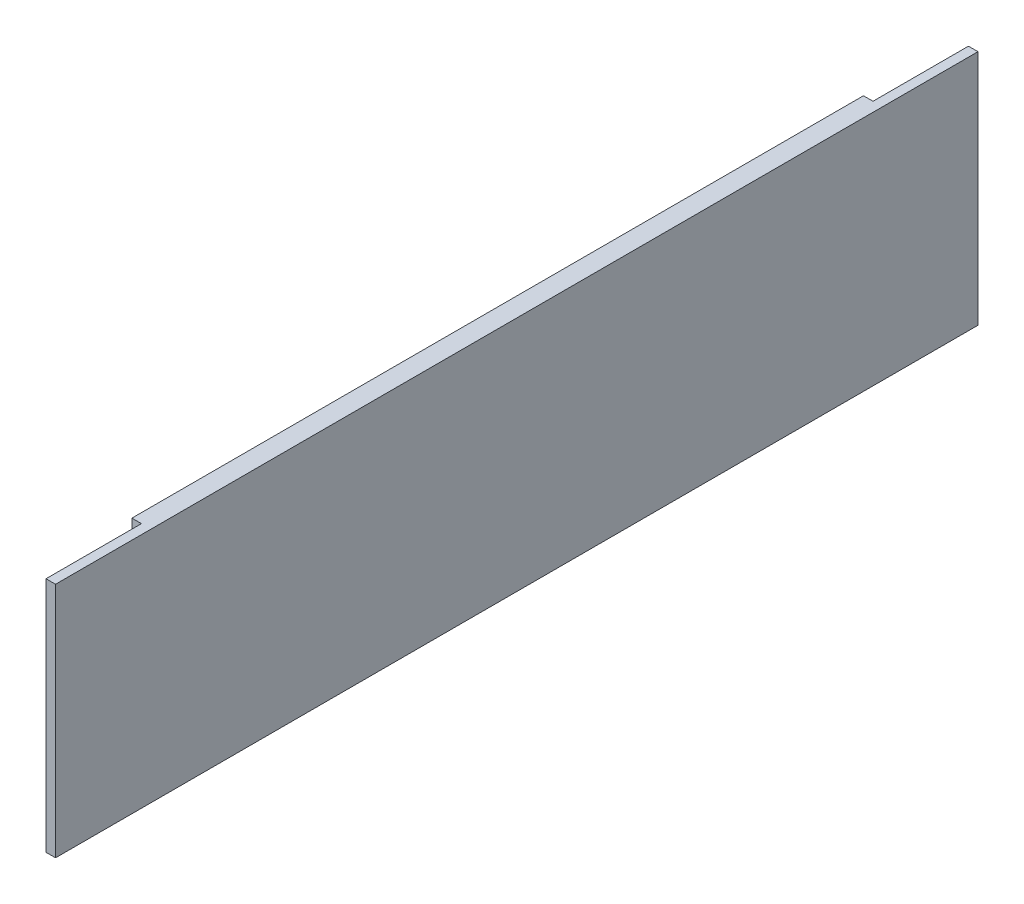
from build123d import *

# Parameters (mm, degrees)
SKETCH_1_W      = 3
SKETCH_1_H      = 290
EXTRUDE_1_DEPTH = 74.492730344
SKETCH_2_W      = 3
SKETCH_2_H      = 230
EXTRUDE_2_DEPTH = 59.492730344


with BuildPart() as part:
    # Sketch 1 → Extrude 1 (new body)
    with BuildSketch(Plane(origin=(0, 68.024665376, 0), x_dir=(1, 0, 0), z_dir=(0, 1, 0))):
        with Locations((-117.802393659, -1965)):
            Rectangle(SKETCH_1_W, SKETCH_1_H)
    extrude(amount=EXTRUDE_1_DEPTH)

    # Sketch 2 → Extrude 2 (add)
    with BuildSketch(Plane(origin=(0, 83.024665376, 0), x_dir=(1, 0, 0), z_dir=(0, 1, 0))):
        with Locations((-120.802393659, -1965)):
            Rectangle(SKETCH_2_W, SKETCH_2_H)
    extrude(amount=EXTRUDE_2_DEPTH)


solid = part.part
